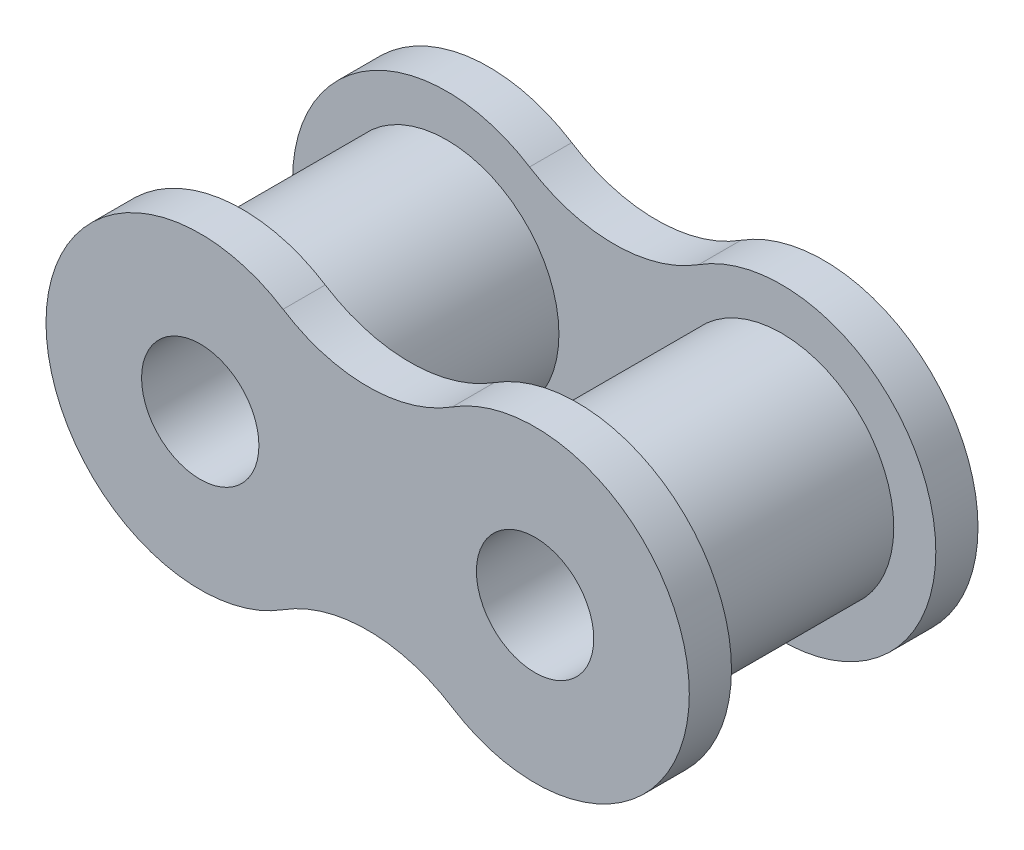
ISO-10303-21;
HEADER;
FILE_DESCRIPTION(('STEP AP214'),'2;1');
FILE_NAME('part.step','',(''),(''),'','','');
FILE_SCHEMA(('AUTOMOTIVE_DESIGN { 1 0 10303 214 1 1 1 1 }'));
ENDSEC;
DATA;
#1=APPLICATION_CONTEXT('core data for automotive mechanical design processes');
#2=APPLICATION_PROTOCOL_DEFINITION('international standard','automotive_design',2000,#1);
#3=PRODUCT_CONTEXT('',#1,'mechanical');
#4=PRODUCT('Part','Part','',(#3));
#5=PRODUCT_RELATED_PRODUCT_CATEGORY('part','',(#4));
#6=PRODUCT_DEFINITION_FORMATION('','',#4);
#7=PRODUCT_DEFINITION_CONTEXT('part definition',#1,'design');
#8=PRODUCT_DEFINITION('design','',#6,#7);
#9=PRODUCT_DEFINITION_SHAPE('','',#8);
#10=(LENGTH_UNIT() NAMED_UNIT(*) SI_UNIT(.MILLI.,.METRE.));
#11=(NAMED_UNIT(*) PLANE_ANGLE_UNIT() SI_UNIT($,.RADIAN.));
#12=(NAMED_UNIT(*) SI_UNIT($,.STERADIAN.) SOLID_ANGLE_UNIT());
#13=UNCERTAINTY_MEASURE_WITH_UNIT(LENGTH_MEASURE(1.E-05),#10,'distance_accuracy_value','');
#14=(GEOMETRIC_REPRESENTATION_CONTEXT(3) GLOBAL_UNCERTAINTY_ASSIGNED_CONTEXT((#13)) GLOBAL_UNIT_ASSIGNED_CONTEXT((#10,
#11,#12)) REPRESENTATION_CONTEXT('',''));
#15=CARTESIAN_POINT('',(0.,0.,0.));
#16=DIRECTION('',(0.,0.,1.));
#17=DIRECTION('',(1.,0.,0.));
#18=AXIS2_PLACEMENT_3D('',#15,#16,#17);
#19=CARTESIAN_POINT('',(-3.175,4.98650250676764,3.875));
#20=DIRECTION('',(0.,0.,1.));
#21=DIRECTION('',(1.,0.,0.));
#22=AXIS2_PLACEMENT_3D('',#19,#20,#21);
#23=PLANE('',#22);
#24=CARTESIAN_POINT('',(0.,0.,3.875));
#25=DIRECTION('',(0.,0.,1.));
#26=DIRECTION('',(1.,0.,0.));
#27=AXIS2_PLACEMENT_3D('',#24,#25,#26);
#28=CIRCLE('',#27,4.255);
#29=CARTESIAN_POINT('',(4.255,0.,3.875));
#30=VERTEX_POINT('',#29);
#31=EDGE_CURVE('E42',#30,#30,#28,.T.);
#32=ORIENTED_EDGE('',*,*,#31,.T.);
#33=EDGE_LOOP('',(#32));
#34=FACE_BOUND('',#33,.T.);
#35=CARTESIAN_POINT('',(-6.35,9.97300501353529,3.875));
#36=DIRECTION('',(0.,0.,-1.));
#37=DIRECTION('',(1.,0.,0.));
#38=AXIS2_PLACEMENT_3D('',#35,#36,#37);
#39=CIRCLE('',#38,5.973);
#40=CARTESIAN_POINT('',(-3.14196904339,4.93462567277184,3.875));
#41=VERTEX_POINT('',#40);
#42=CARTESIAN_POINT('',(-9.55803095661,4.93462567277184,3.875));
#43=VERTEX_POINT('',#42);
#44=EDGE_CURVE('E152',#41,#43,#39,.T.);
#45=ORIENTED_EDGE('',*,*,#44,.F.);
#46=CARTESIAN_POINT('',(0.,0.,3.875));
#47=DIRECTION('',(0.,0.,1.));
#48=DIRECTION('',(1.,0.,0.));
#49=AXIS2_PLACEMENT_3D('',#46,#47,#48);
#50=CIRCLE('',#49,5.85);
#51=CARTESIAN_POINT('',(-3.14196904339,-4.93462567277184,3.875));
#52=VERTEX_POINT('',#51);
#53=EDGE_CURVE('E74',#52,#41,#50,.T.);
#54=ORIENTED_EDGE('',*,*,#53,.F.);
#55=CARTESIAN_POINT('',(-6.35,-9.97300501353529,3.875));
#56=DIRECTION('',(0.,0.,-1.));
#57=DIRECTION('',(-1.,0.,0.));
#58=AXIS2_PLACEMENT_3D('',#55,#56,#57);
#59=CIRCLE('',#58,5.973);
#60=CARTESIAN_POINT('',(-9.55803095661,-4.93462567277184,3.875));
#61=VERTEX_POINT('',#60);
#62=EDGE_CURVE('E68',#61,#52,#59,.T.);
#63=ORIENTED_EDGE('',*,*,#62,.F.);
#64=CARTESIAN_POINT('',(-12.7,0.,3.875));
#65=DIRECTION('',(0.,0.,1.));
#66=DIRECTION('',(1.,0.,0.));
#67=AXIS2_PLACEMENT_3D('',#64,#65,#66);
#68=CIRCLE('',#67,5.85);
#69=EDGE_CURVE('E162',#43,#61,#68,.T.);
#70=ORIENTED_EDGE('',*,*,#69,.F.);
#71=EDGE_LOOP('',(#45,#54,#63,#70));
#72=FACE_BOUND('',#71,.T.);
#73=CARTESIAN_POINT('',(-12.7,0.,3.875));
#74=DIRECTION('',(0.,0.,1.));
#75=DIRECTION('',(1.,0.,0.));
#76=AXIS2_PLACEMENT_3D('',#73,#74,#75);
#77=CIRCLE('',#76,4.255);
#78=CARTESIAN_POINT('',(-8.445,0.,3.875));
#79=VERTEX_POINT('',#78);
#80=EDGE_CURVE('E11',#79,#79,#77,.F.);
#81=ORIENTED_EDGE('',*,*,#80,.F.);
#82=EDGE_LOOP('',(#81));
#83=FACE_BOUND('',#82,.T.);
#84=ADVANCED_FACE('F33',(#34,#72,#83),#23,.F.);
#85=CARTESIAN_POINT('',(0.,0.,3.875));
#86=DIRECTION('',(0.,0.,-1.));
#87=DIRECTION('',(-1.,0.,0.));
#88=AXIS2_PLACEMENT_3D('',#85,#86,#87);
#89=CYLINDRICAL_SURFACE('',#88,4.255);
#90=ORIENTED_EDGE('',*,*,#31,.F.);
#91=EDGE_LOOP('',(#90));
#92=FACE_BOUND('',#91,.T.);
#93=CARTESIAN_POINT('',(0.,0.,-3.875));
#94=DIRECTION('',(0.,0.,-1.));
#95=DIRECTION('',(-1.,0.,0.));
#96=AXIS2_PLACEMENT_3D('',#93,#94,#95);
#97=CIRCLE('',#96,4.255);
#98=CARTESIAN_POINT('',(-4.255,0.,-3.875));
#99=VERTEX_POINT('',#98);
#100=EDGE_CURVE('E138',#99,#99,#97,.T.);
#101=ORIENTED_EDGE('',*,*,#100,.F.);
#102=EDGE_LOOP('',(#101));
#103=FACE_BOUND('',#102,.T.);
#104=ADVANCED_FACE('F35',(#92,#103),#89,.T.);
#105=CARTESIAN_POINT('',(0.,0.,3.875));
#106=DIRECTION('',(0.,0.,-1.));
#107=DIRECTION('',(-1.,0.,0.));
#108=AXIS2_PLACEMENT_3D('',#105,#106,#107);
#109=CYLINDRICAL_SURFACE('',#108,2.225);
#110=CARTESIAN_POINT('',(0.,0.,5.475));
#111=DIRECTION('',(0.,0.,1.));
#112=DIRECTION('',(1.,0.,0.));
#113=AXIS2_PLACEMENT_3D('',#110,#111,#112);
#114=CIRCLE('',#113,2.225);
#115=CARTESIAN_POINT('',(2.225,0.,5.475));
#116=VERTEX_POINT('',#115);
#117=EDGE_CURVE('E149',#116,#116,#114,.T.);
#118=ORIENTED_EDGE('',*,*,#117,.T.);
#119=EDGE_LOOP('',(#118));
#120=FACE_BOUND('',#119,.T.);
#121=CARTESIAN_POINT('',(0.,0.,-5.475));
#122=DIRECTION('',(0.,0.,-1.));
#123=DIRECTION('',(-1.,0.,0.));
#124=AXIS2_PLACEMENT_3D('',#121,#122,#123);
#125=CIRCLE('',#124,2.225);
#126=CARTESIAN_POINT('',(-2.225,0.,-5.475));
#127=VERTEX_POINT('',#126);
#128=EDGE_CURVE('E228',#127,#127,#125,.T.);
#129=ORIENTED_EDGE('',*,*,#128,.T.);
#130=EDGE_LOOP('',(#129));
#131=FACE_BOUND('',#130,.T.);
#132=ADVANCED_FACE('F179',(#120,#131),#109,.F.);
#133=CARTESIAN_POINT('',(-3.175,4.98650250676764,5.475));
#134=DIRECTION('',(0.,0.,1.));
#135=DIRECTION('',(1.,0.,0.));
#136=AXIS2_PLACEMENT_3D('',#133,#134,#135);
#137=PLANE('',#136);
#138=ORIENTED_EDGE('',*,*,#117,.F.);
#139=EDGE_LOOP('',(#138));
#140=FACE_BOUND('',#139,.T.);
#141=CARTESIAN_POINT('',(-6.35,9.97300501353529,5.475));
#142=DIRECTION('',(0.,0.,-1.));
#143=DIRECTION('',(1.,0.,0.));
#144=AXIS2_PLACEMENT_3D('',#141,#142,#143);
#145=CIRCLE('',#144,5.973);
#146=CARTESIAN_POINT('',(-3.14196904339,4.93462567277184,5.475));
#147=VERTEX_POINT('',#146);
#148=CARTESIAN_POINT('',(-9.55803095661,4.93462567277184,5.475));
#149=VERTEX_POINT('',#148);
#150=EDGE_CURVE('E153',#147,#149,#145,.T.);
#151=ORIENTED_EDGE('',*,*,#150,.T.);
#152=CARTESIAN_POINT('',(-12.7,0.,5.475));
#153=DIRECTION('',(0.,0.,1.));
#154=DIRECTION('',(1.,0.,0.));
#155=AXIS2_PLACEMENT_3D('',#152,#153,#154);
#156=CIRCLE('',#155,5.85);
#157=CARTESIAN_POINT('',(-9.55803095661,-4.93462567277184,5.475));
#158=VERTEX_POINT('',#157);
#159=EDGE_CURVE('E82',#149,#158,#156,.T.);
#160=ORIENTED_EDGE('',*,*,#159,.T.);
#161=CARTESIAN_POINT('',(-6.35,-9.97300501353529,5.475));
#162=DIRECTION('',(0.,0.,-1.));
#163=DIRECTION('',(-1.,0.,0.));
#164=AXIS2_PLACEMENT_3D('',#161,#162,#163);
#165=CIRCLE('',#164,5.973);
#166=CARTESIAN_POINT('',(-3.14196904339,-4.93462567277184,5.475));
#167=VERTEX_POINT('',#166);
#168=EDGE_CURVE('E156',#158,#167,#165,.T.);
#169=ORIENTED_EDGE('',*,*,#168,.T.);
#170=CARTESIAN_POINT('',(0.,0.,5.475));
#171=DIRECTION('',(0.,0.,1.));
#172=DIRECTION('',(1.,0.,0.));
#173=AXIS2_PLACEMENT_3D('',#170,#171,#172);
#174=CIRCLE('',#173,5.85);
#175=EDGE_CURVE('E50',#167,#147,#174,.T.);
#176=ORIENTED_EDGE('',*,*,#175,.T.);
#177=EDGE_LOOP('',(#151,#160,#169,#176));
#178=FACE_BOUND('',#177,.T.);
#179=CARTESIAN_POINT('',(-12.7,0.,5.475));
#180=DIRECTION('',(0.,0.,1.));
#181=DIRECTION('',(1.,0.,0.));
#182=AXIS2_PLACEMENT_3D('',#179,#180,#181);
#183=CIRCLE('',#182,2.225);
#184=CARTESIAN_POINT('',(-10.475,0.,5.475));
#185=VERTEX_POINT('',#184);
#186=EDGE_CURVE('E146',#185,#185,#183,.T.);
#187=ORIENTED_EDGE('',*,*,#186,.F.);
#188=EDGE_LOOP('',(#187));
#189=FACE_BOUND('',#188,.T.);
#190=ADVANCED_FACE('F204',(#140,#178,#189),#137,.T.);
#191=CARTESIAN_POINT('',(-6.35,9.97300501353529,5.475));
#192=DIRECTION('',(0.,0.,-1.));
#193=DIRECTION('',(-1.,0.,0.));
#194=AXIS2_PLACEMENT_3D('',#191,#192,#193);
#195=CYLINDRICAL_SURFACE('',#194,5.973);
#196=ORIENTED_EDGE('',*,*,#44,.T.);
#197=DIRECTION('',(0.,0.,-1.));
#198=VECTOR('',#197,1.);
#199=CARTESIAN_POINT('',(-9.55803095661,4.93462567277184,5.475));
#200=LINE('',#199,#198);
#201=EDGE_CURVE('E171',#149,#43,#200,.T.);
#202=ORIENTED_EDGE('',*,*,#201,.F.);
#203=ORIENTED_EDGE('',*,*,#150,.F.);
#204=DIRECTION('',(0.,0.,-1.));
#205=VECTOR('',#204,1.);
#206=CARTESIAN_POINT('',(-3.14196904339,4.93462567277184,5.475));
#207=LINE('',#206,#205);
#208=EDGE_CURVE('E159',#147,#41,#207,.T.);
#209=ORIENTED_EDGE('',*,*,#208,.T.);
#210=EDGE_LOOP('',(#196,#202,#203,#209));
#211=FACE_BOUND('',#210,.T.);
#212=ADVANCED_FACE('F215',(#211),#195,.F.);
#213=CARTESIAN_POINT('',(-12.7,0.,5.475));
#214=DIRECTION('',(0.,0.,-1.));
#215=DIRECTION('',(-1.,0.,0.));
#216=AXIS2_PLACEMENT_3D('',#213,#214,#215);
#217=CYLINDRICAL_SURFACE('',#216,5.85);
#218=ORIENTED_EDGE('',*,*,#69,.T.);
#219=DIRECTION('',(0.,0.,-1.));
#220=VECTOR('',#219,1.);
#221=CARTESIAN_POINT('',(-9.55803095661,-4.93462567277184,5.475));
#222=LINE('',#221,#220);
#223=EDGE_CURVE('E169',#158,#61,#222,.T.);
#224=ORIENTED_EDGE('',*,*,#223,.F.);
#225=ORIENTED_EDGE('',*,*,#159,.F.);
#226=ORIENTED_EDGE('',*,*,#201,.T.);
#227=EDGE_LOOP('',(#218,#224,#225,#226));
#228=FACE_BOUND('',#227,.T.);
#229=ADVANCED_FACE('F212',(#228),#217,.T.);
#230=CARTESIAN_POINT('',(-6.35,-9.97300501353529,5.475));
#231=DIRECTION('',(0.,0.,-1.));
#232=DIRECTION('',(-1.,0.,0.));
#233=AXIS2_PLACEMENT_3D('',#230,#231,#232);
#234=CYLINDRICAL_SURFACE('',#233,5.973);
#235=ORIENTED_EDGE('',*,*,#62,.T.);
#236=DIRECTION('',(0.,0.,-1.));
#237=VECTOR('',#236,1.);
#238=CARTESIAN_POINT('',(-3.14196904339,-4.93462567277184,5.475));
#239=LINE('',#238,#237);
#240=EDGE_CURVE('E167',#167,#52,#239,.T.);
#241=ORIENTED_EDGE('',*,*,#240,.F.);
#242=ORIENTED_EDGE('',*,*,#168,.F.);
#243=ORIENTED_EDGE('',*,*,#223,.T.);
#244=EDGE_LOOP('',(#235,#241,#242,#243));
#245=FACE_BOUND('',#244,.T.);
#246=ADVANCED_FACE('F209',(#245),#234,.F.);
#247=CARTESIAN_POINT('',(0.,0.,5.475));
#248=DIRECTION('',(0.,0.,-1.));
#249=DIRECTION('',(-1.,0.,0.));
#250=AXIS2_PLACEMENT_3D('',#247,#248,#249);
#251=CYLINDRICAL_SURFACE('',#250,5.85);
#252=ORIENTED_EDGE('',*,*,#53,.T.);
#253=ORIENTED_EDGE('',*,*,#208,.F.);
#254=ORIENTED_EDGE('',*,*,#175,.F.);
#255=ORIENTED_EDGE('',*,*,#240,.T.);
#256=EDGE_LOOP('',(#252,#253,#254,#255));
#257=FACE_BOUND('',#256,.T.);
#258=ADVANCED_FACE('F206',(#257),#251,.T.);
#259=CARTESIAN_POINT('',(-12.7,0.,5.475));
#260=DIRECTION('',(0.,0.,-1.));
#261=DIRECTION('',(-1.,0.,0.));
#262=AXIS2_PLACEMENT_3D('',#259,#260,#261);
#263=CYLINDRICAL_SURFACE('',#262,2.225);
#264=ORIENTED_EDGE('',*,*,#186,.T.);
#265=EDGE_LOOP('',(#264));
#266=FACE_BOUND('',#265,.T.);
#267=CARTESIAN_POINT('',(-12.7,0.,-5.475));
#268=DIRECTION('',(0.,0.,-1.));
#269=DIRECTION('',(-1.,0.,0.));
#270=AXIS2_PLACEMENT_3D('',#267,#268,#269);
#271=CIRCLE('',#270,2.225);
#272=CARTESIAN_POINT('',(-14.925,0.,-5.475));
#273=VERTEX_POINT('',#272);
#274=EDGE_CURVE('E229',#273,#273,#271,.T.);
#275=ORIENTED_EDGE('',*,*,#274,.T.);
#276=EDGE_LOOP('',(#275));
#277=FACE_BOUND('',#276,.T.);
#278=ADVANCED_FACE('F193',(#266,#277),#263,.F.);
#279=CARTESIAN_POINT('',(-12.7,0.,3.875));
#280=DIRECTION('',(0.,0.,-1.));
#281=DIRECTION('',(-1.,0.,0.));
#282=AXIS2_PLACEMENT_3D('',#279,#280,#281);
#283=CYLINDRICAL_SURFACE('',#282,4.255);
#284=ORIENTED_EDGE('',*,*,#80,.T.);
#285=EDGE_LOOP('',(#284));
#286=FACE_BOUND('',#285,.T.);
#287=CARTESIAN_POINT('',(-12.7,0.,-3.875));
#288=DIRECTION('',(0.,0.,-1.));
#289=DIRECTION('',(-1.,0.,0.));
#290=AXIS2_PLACEMENT_3D('',#287,#288,#289);
#291=CIRCLE('',#290,4.255);
#292=CARTESIAN_POINT('',(-16.955,0.,-3.875));
#293=VERTEX_POINT('',#292);
#294=EDGE_CURVE('E135',#293,#293,#291,.T.);
#295=ORIENTED_EDGE('',*,*,#294,.F.);
#296=EDGE_LOOP('',(#295));
#297=FACE_BOUND('',#296,.T.);
#298=ADVANCED_FACE('F184',(#286,#297),#283,.T.);
#299=CARTESIAN_POINT('',(-9.525,4.98650250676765,-3.875));
#300=DIRECTION('',(0.,0.,-1.));
#301=DIRECTION('',(-1.,0.,0.));
#302=AXIS2_PLACEMENT_3D('',#299,#300,#301);
#303=PLANE('',#302);
#304=ORIENTED_EDGE('',*,*,#294,.T.);
#305=EDGE_LOOP('',(#304));
#306=FACE_BOUND('',#305,.T.);
#307=CARTESIAN_POINT('',(-6.35,9.9730050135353,-3.875));
#308=DIRECTION('',(0.,0.,1.));
#309=DIRECTION('',(-1.,0.,0.));
#310=AXIS2_PLACEMENT_3D('',#307,#308,#309);
#311=CIRCLE('',#310,5.97300000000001);
#312=CARTESIAN_POINT('',(-9.55803095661,4.93462567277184,-3.875));
#313=VERTEX_POINT('',#312);
#314=CARTESIAN_POINT('',(-3.14196904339,4.93462567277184,-3.875));
#315=VERTEX_POINT('',#314);
#316=EDGE_CURVE('E134',#313,#315,#311,.T.);
#317=ORIENTED_EDGE('',*,*,#316,.F.);
#318=CARTESIAN_POINT('',(-12.7,0.,-3.875));
#319=DIRECTION('',(0.,0.,-1.));
#320=DIRECTION('',(-1.,0.,0.));
#321=AXIS2_PLACEMENT_3D('',#318,#319,#320);
#322=CIRCLE('',#321,5.85);
#323=CARTESIAN_POINT('',(-9.55803095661,-4.93462567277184,-3.875));
#324=VERTEX_POINT('',#323);
#325=EDGE_CURVE('E130',#324,#313,#322,.T.);
#326=ORIENTED_EDGE('',*,*,#325,.F.);
#327=CARTESIAN_POINT('',(-6.35,-9.9730050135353,-3.875));
#328=DIRECTION('',(0.,0.,1.));
#329=DIRECTION('',(1.,0.,0.));
#330=AXIS2_PLACEMENT_3D('',#327,#328,#329);
#331=CIRCLE('',#330,5.97300000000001);
#332=CARTESIAN_POINT('',(-3.14196904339,-4.93462567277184,-3.875));
#333=VERTEX_POINT('',#332);
#334=EDGE_CURVE('E240',#333,#324,#331,.T.);
#335=ORIENTED_EDGE('',*,*,#334,.F.);
#336=CARTESIAN_POINT('',(0.,0.,-3.875));
#337=DIRECTION('',(0.,0.,-1.));
#338=DIRECTION('',(-1.,0.,0.));
#339=AXIS2_PLACEMENT_3D('',#336,#337,#338);
#340=CIRCLE('',#339,5.85);
#341=EDGE_CURVE('E231',#315,#333,#340,.T.);
#342=ORIENTED_EDGE('',*,*,#341,.F.);
#343=EDGE_LOOP('',(#317,#326,#335,#342));
#344=FACE_BOUND('',#343,.T.);
#345=ORIENTED_EDGE('',*,*,#100,.T.);
#346=EDGE_LOOP('',(#345));
#347=FACE_BOUND('',#346,.T.);
#348=ADVANCED_FACE('F182',(#306,#344,#347),#303,.F.);
#349=CARTESIAN_POINT('',(-9.525,4.98650250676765,-5.475));
#350=DIRECTION('',(0.,0.,-1.));
#351=DIRECTION('',(-1.,0.,0.));
#352=AXIS2_PLACEMENT_3D('',#349,#350,#351);
#353=PLANE('',#352);
#354=ORIENTED_EDGE('',*,*,#128,.F.);
#355=EDGE_LOOP('',(#354));
#356=FACE_BOUND('',#355,.T.);
#357=CARTESIAN_POINT('',(-6.35,9.9730050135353,-5.475));
#358=DIRECTION('',(0.,0.,1.));
#359=DIRECTION('',(-1.,0.,0.));
#360=AXIS2_PLACEMENT_3D('',#357,#358,#359);
#361=CIRCLE('',#360,5.97300000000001);
#362=CARTESIAN_POINT('',(-9.55803095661,4.93462567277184,-5.475));
#363=VERTEX_POINT('',#362);
#364=CARTESIAN_POINT('',(-3.14196904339,4.93462567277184,-5.475));
#365=VERTEX_POINT('',#364);
#366=EDGE_CURVE('E120',#363,#365,#361,.T.);
#367=ORIENTED_EDGE('',*,*,#366,.T.);
#368=CARTESIAN_POINT('',(0.,0.,-5.475));
#369=DIRECTION('',(0.,0.,-1.));
#370=DIRECTION('',(-1.,0.,0.));
#371=AXIS2_PLACEMENT_3D('',#368,#369,#370);
#372=CIRCLE('',#371,5.85);
#373=CARTESIAN_POINT('',(-3.14196904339,-4.93462567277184,-5.475));
#374=VERTEX_POINT('',#373);
#375=EDGE_CURVE('E109',#365,#374,#372,.T.);
#376=ORIENTED_EDGE('',*,*,#375,.T.);
#377=CARTESIAN_POINT('',(-6.35,-9.9730050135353,-5.475));
#378=DIRECTION('',(0.,0.,1.));
#379=DIRECTION('',(1.,0.,0.));
#380=AXIS2_PLACEMENT_3D('',#377,#378,#379);
#381=CIRCLE('',#380,5.97300000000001);
#382=CARTESIAN_POINT('',(-9.55803095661,-4.93462567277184,-5.475));
#383=VERTEX_POINT('',#382);
#384=EDGE_CURVE('E119',#374,#383,#381,.T.);
#385=ORIENTED_EDGE('',*,*,#384,.T.);
#386=CARTESIAN_POINT('',(-12.7,0.,-5.475));
#387=DIRECTION('',(0.,0.,-1.));
#388=DIRECTION('',(-1.,0.,0.));
#389=AXIS2_PLACEMENT_3D('',#386,#387,#388);
#390=CIRCLE('',#389,5.85);
#391=EDGE_CURVE('E126',#383,#363,#390,.T.);
#392=ORIENTED_EDGE('',*,*,#391,.T.);
#393=EDGE_LOOP('',(#367,#376,#385,#392));
#394=FACE_BOUND('',#393,.T.);
#395=ORIENTED_EDGE('',*,*,#274,.F.);
#396=EDGE_LOOP('',(#395));
#397=FACE_BOUND('',#396,.T.);
#398=ADVANCED_FACE('F123',(#356,#394,#397),#353,.T.);
#399=CARTESIAN_POINT('',(-6.35,9.9730050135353,-5.475));
#400=DIRECTION('',(0.,0.,1.));
#401=DIRECTION('',(1.,0.,0.));
#402=AXIS2_PLACEMENT_3D('',#399,#400,#401);
#403=CYLINDRICAL_SURFACE('',#402,5.97300000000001);
#404=ORIENTED_EDGE('',*,*,#316,.T.);
#405=DIRECTION('',(0.,0.,1.));
#406=VECTOR('',#405,1.);
#407=CARTESIAN_POINT('',(-3.14196904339,4.93462567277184,-5.475));
#408=LINE('',#407,#406);
#409=EDGE_CURVE('E113',#365,#315,#408,.T.);
#410=ORIENTED_EDGE('',*,*,#409,.F.);
#411=ORIENTED_EDGE('',*,*,#366,.F.);
#412=DIRECTION('',(0.,0.,1.));
#413=VECTOR('',#412,1.);
#414=CARTESIAN_POINT('',(-9.55803095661,4.93462567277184,-5.475));
#415=LINE('',#414,#413);
#416=EDGE_CURVE('E237',#363,#313,#415,.T.);
#417=ORIENTED_EDGE('',*,*,#416,.T.);
#418=EDGE_LOOP('',(#404,#410,#411,#417));
#419=FACE_BOUND('',#418,.T.);
#420=ADVANCED_FACE('F132',(#419),#403,.F.);
#421=CARTESIAN_POINT('',(0.,0.,-5.475));
#422=DIRECTION('',(0.,0.,1.));
#423=DIRECTION('',(1.,0.,0.));
#424=AXIS2_PLACEMENT_3D('',#421,#422,#423);
#425=CYLINDRICAL_SURFACE('',#424,5.85);
#426=ORIENTED_EDGE('',*,*,#341,.T.);
#427=DIRECTION('',(0.,0.,1.));
#428=VECTOR('',#427,1.);
#429=CARTESIAN_POINT('',(-3.14196904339,-4.93462567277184,-5.475));
#430=LINE('',#429,#428);
#431=EDGE_CURVE('E116',#374,#333,#430,.T.);
#432=ORIENTED_EDGE('',*,*,#431,.F.);
#433=ORIENTED_EDGE('',*,*,#375,.F.);
#434=ORIENTED_EDGE('',*,*,#409,.T.);
#435=EDGE_LOOP('',(#426,#432,#433,#434));
#436=FACE_BOUND('',#435,.T.);
#437=ADVANCED_FACE('F111',(#436),#425,.T.);
#438=CARTESIAN_POINT('',(-6.35,-9.9730050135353,-5.475));
#439=DIRECTION('',(0.,0.,1.));
#440=DIRECTION('',(1.,0.,0.));
#441=AXIS2_PLACEMENT_3D('',#438,#439,#440);
#442=CYLINDRICAL_SURFACE('',#441,5.97300000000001);
#443=ORIENTED_EDGE('',*,*,#334,.T.);
#444=DIRECTION('',(0.,0.,1.));
#445=VECTOR('',#444,1.);
#446=CARTESIAN_POINT('',(-9.55803095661,-4.93462567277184,-5.475));
#447=LINE('',#446,#445);
#448=EDGE_CURVE('E140',#383,#324,#447,.T.);
#449=ORIENTED_EDGE('',*,*,#448,.F.);
#450=ORIENTED_EDGE('',*,*,#384,.F.);
#451=ORIENTED_EDGE('',*,*,#431,.T.);
#452=EDGE_LOOP('',(#443,#449,#450,#451));
#453=FACE_BOUND('',#452,.T.);
#454=ADVANCED_FACE('F250',(#453),#442,.F.);
#455=CARTESIAN_POINT('',(-12.7,0.,-5.475));
#456=DIRECTION('',(0.,0.,1.));
#457=DIRECTION('',(1.,0.,0.));
#458=AXIS2_PLACEMENT_3D('',#455,#456,#457);
#459=CYLINDRICAL_SURFACE('',#458,5.85);
#460=ORIENTED_EDGE('',*,*,#325,.T.);
#461=ORIENTED_EDGE('',*,*,#416,.F.);
#462=ORIENTED_EDGE('',*,*,#391,.F.);
#463=ORIENTED_EDGE('',*,*,#448,.T.);
#464=EDGE_LOOP('',(#460,#461,#462,#463));
#465=FACE_BOUND('',#464,.T.);
#466=ADVANCED_FACE('F247',(#465),#459,.T.);
#467=CLOSED_SHELL('',(#84,#104,#132,#190,#212,#229,#246,#258,#278,#298,#348,#398,#420,#437,#454,#466));
#468=MANIFOLD_SOLID_BREP('B2',#467);
#469=ADVANCED_BREP_SHAPE_REPRESENTATION('',(#18,#468),#14);
#470=SHAPE_DEFINITION_REPRESENTATION(#9,#469);
ENDSEC;
END-ISO-10303-21;
